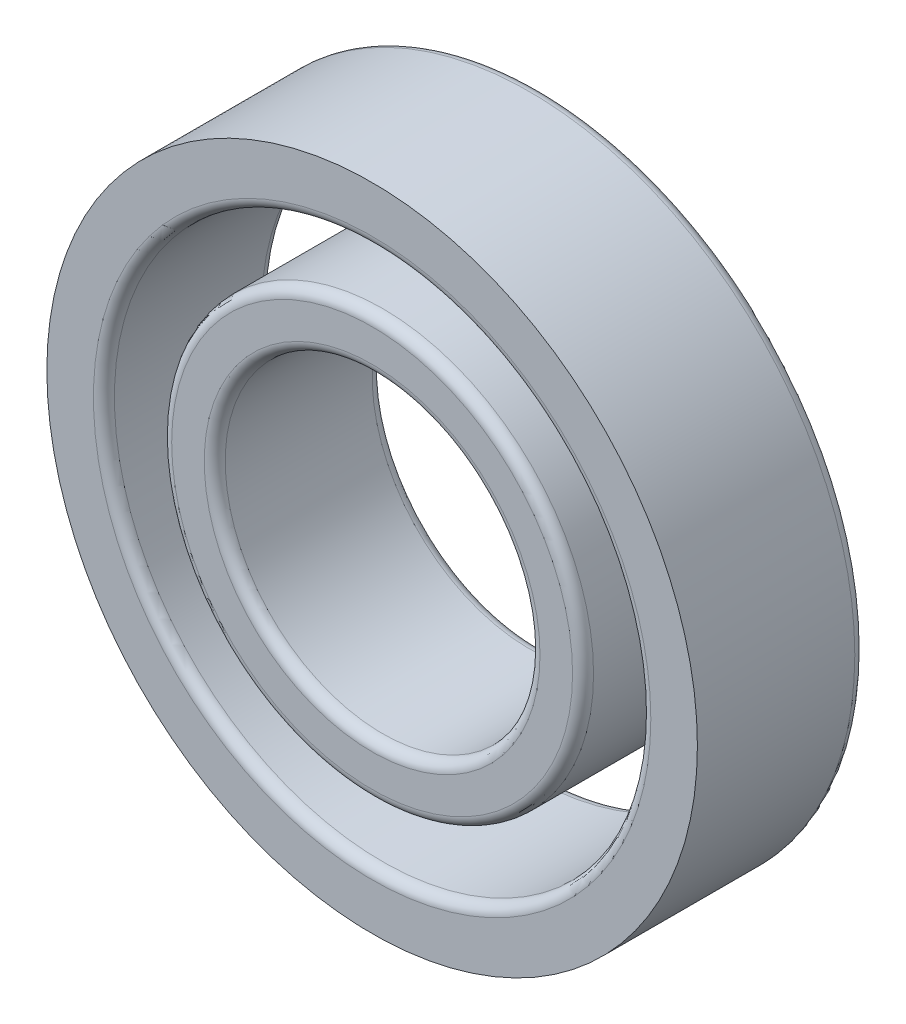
ISO-10303-21;
HEADER;
FILE_DESCRIPTION(('STEP AP214'),'2;1');
FILE_NAME('part.step','',(''),(''),'','','');
FILE_SCHEMA(('AUTOMOTIVE_DESIGN { 1 0 10303 214 1 1 1 1 }'));
ENDSEC;
DATA;
#1=APPLICATION_CONTEXT('core data for automotive mechanical design processes');
#2=APPLICATION_PROTOCOL_DEFINITION('international standard','automotive_design',2000,#1);
#3=PRODUCT_CONTEXT('',#1,'mechanical');
#4=PRODUCT('Part','Part','',(#3));
#5=PRODUCT_RELATED_PRODUCT_CATEGORY('part','',(#4));
#6=PRODUCT_DEFINITION_FORMATION('','',#4);
#7=PRODUCT_DEFINITION_CONTEXT('part definition',#1,'design');
#8=PRODUCT_DEFINITION('design','',#6,#7);
#9=PRODUCT_DEFINITION_SHAPE('','',#8);
#10=(LENGTH_UNIT() NAMED_UNIT(*) SI_UNIT(.MILLI.,.METRE.));
#11=(NAMED_UNIT(*) PLANE_ANGLE_UNIT() SI_UNIT($,.RADIAN.));
#12=(NAMED_UNIT(*) SI_UNIT($,.STERADIAN.) SOLID_ANGLE_UNIT());
#13=UNCERTAINTY_MEASURE_WITH_UNIT(LENGTH_MEASURE(1.E-05),#10,'distance_accuracy_value','');
#14=(GEOMETRIC_REPRESENTATION_CONTEXT(3) GLOBAL_UNCERTAINTY_ASSIGNED_CONTEXT((#13)) GLOBAL_UNIT_ASSIGNED_CONTEXT((#10,
#11,#12)) REPRESENTATION_CONTEXT('',''));
#15=CARTESIAN_POINT('',(0.,0.,0.));
#16=DIRECTION('',(0.,0.,1.));
#17=DIRECTION('',(1.,0.,0.));
#18=AXIS2_PLACEMENT_3D('',#15,#16,#17);
#19=CARTESIAN_POINT('',(0.,0.,16.));
#20=DIRECTION('',(0.,0.,-1.));
#21=DIRECTION('',(-1.,0.,0.));
#22=AXIS2_PLACEMENT_3D('',#19,#20,#21);
#23=CYLINDRICAL_SURFACE('',#22,15.);
#24=CARTESIAN_POINT('',(0.,0.,15.));
#25=DIRECTION('',(0.,0.,1.));
#26=DIRECTION('',(1.,0.,0.));
#27=AXIS2_PLACEMENT_3D('',#24,#25,#26);
#28=CIRCLE('',#27,15.);
#29=CARTESIAN_POINT('',(15.,0.,15.));
#30=VERTEX_POINT('',#29);
#31=EDGE_CURVE('E71',#30,#30,#28,.T.);
#32=ORIENTED_EDGE('',*,*,#31,.T.);
#33=EDGE_LOOP('',(#32));
#34=FACE_BOUND('',#33,.T.);
#35=CARTESIAN_POINT('',(0.,0.,1.));
#36=DIRECTION('',(0.,0.,1.));
#37=DIRECTION('',(1.,0.,0.));
#38=AXIS2_PLACEMENT_3D('',#35,#36,#37);
#39=CIRCLE('',#38,15.);
#40=CARTESIAN_POINT('',(15.,0.,1.));
#41=VERTEX_POINT('',#40);
#42=EDGE_CURVE('E74',#41,#41,#39,.F.);
#43=ORIENTED_EDGE('',*,*,#42,.T.);
#44=EDGE_LOOP('',(#43));
#45=FACE_BOUND('',#44,.T.);
#46=ADVANCED_FACE('F45',(#34,#45),#23,.F.);
#47=CARTESIAN_POINT('',(0.,0.,16.));
#48=DIRECTION('',(0.,0.,-1.));
#49=DIRECTION('',(-1.,0.,0.));
#50=AXIS2_PLACEMENT_3D('',#47,#48,#49);
#51=CYLINDRICAL_SURFACE('',#50,20.1028973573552);
#52=CARTESIAN_POINT('',(0.,0.,15.));
#53=DIRECTION('',(0.,0.,1.));
#54=DIRECTION('',(1.,0.,0.));
#55=AXIS2_PLACEMENT_3D('',#52,#53,#54);
#56=CIRCLE('',#55,20.1028973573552);
#57=CARTESIAN_POINT('',(20.1028973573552,0.,15.));
#58=VERTEX_POINT('',#57);
#59=EDGE_CURVE('E56',#58,#58,#56,.F.);
#60=ORIENTED_EDGE('',*,*,#59,.T.);
#61=EDGE_LOOP('',(#60));
#62=FACE_BOUND('',#61,.T.);
#63=CARTESIAN_POINT('',(0.,0.,1.));
#64=DIRECTION('',(0.,0.,1.));
#65=DIRECTION('',(1.,0.,0.));
#66=AXIS2_PLACEMENT_3D('',#63,#64,#65);
#67=CIRCLE('',#66,20.1028973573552);
#68=CARTESIAN_POINT('',(20.1028973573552,0.,1.));
#69=VERTEX_POINT('',#68);
#70=EDGE_CURVE('E60',#69,#69,#67,.T.);
#71=ORIENTED_EDGE('',*,*,#70,.T.);
#72=EDGE_LOOP('',(#71));
#73=FACE_BOUND('',#72,.T.);
#74=ADVANCED_FACE('F92',(#62,#73),#51,.T.);
#75=CARTESIAN_POINT('',(0.,-68.3414213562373,16.));
#76=DIRECTION('',(0.,0.,1.));
#77=DIRECTION('',(1.,0.,0.));
#78=AXIS2_PLACEMENT_3D('',#75,#76,#77);
#79=PLANE('',#78);
#80=CARTESIAN_POINT('',(0.,0.,16.));
#81=DIRECTION('',(0.,0.,1.));
#82=DIRECTION('',(1.,0.,0.));
#83=AXIS2_PLACEMENT_3D('',#80,#81,#82);
#84=CIRCLE('',#83,16.);
#85=CARTESIAN_POINT('',(16.,0.,16.));
#86=VERTEX_POINT('',#85);
#87=EDGE_CURVE('E65',#86,#86,#84,.F.);
#88=ORIENTED_EDGE('',*,*,#87,.T.);
#89=EDGE_LOOP('',(#88));
#90=FACE_BOUND('',#89,.T.);
#91=CARTESIAN_POINT('',(0.,0.,16.));
#92=DIRECTION('',(0.,0.,1.));
#93=DIRECTION('',(1.,0.,0.));
#94=AXIS2_PLACEMENT_3D('',#91,#92,#93);
#95=CIRCLE('',#94,19.1028973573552);
#96=CARTESIAN_POINT('',(19.1028973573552,0.,16.));
#97=VERTEX_POINT('',#96);
#98=EDGE_CURVE('E68',#97,#97,#95,.T.);
#99=ORIENTED_EDGE('',*,*,#98,.T.);
#100=EDGE_LOOP('',(#99));
#101=FACE_BOUND('',#100,.T.);
#102=ADVANCED_FACE('F98',(#90,#101),#79,.T.);
#103=CARTESIAN_POINT('',(0.,-68.3414213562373,0.));
#104=DIRECTION('',(0.,0.,1.));
#105=DIRECTION('',(1.,0.,0.));
#106=AXIS2_PLACEMENT_3D('',#103,#104,#105);
#107=PLANE('',#106);
#108=CARTESIAN_POINT('',(0.,0.,0.));
#109=DIRECTION('',(0.,0.,1.));
#110=DIRECTION('',(1.,0.,0.));
#111=AXIS2_PLACEMENT_3D('',#108,#109,#110);
#112=CIRCLE('',#111,16.);
#113=CARTESIAN_POINT('',(16.,0.,0.));
#114=VERTEX_POINT('',#113);
#115=EDGE_CURVE('E12',#114,#114,#112,.T.);
#116=ORIENTED_EDGE('',*,*,#115,.T.);
#117=EDGE_LOOP('',(#116));
#118=FACE_BOUND('',#117,.T.);
#119=CARTESIAN_POINT('',(0.,0.,0.));
#120=DIRECTION('',(0.,0.,1.));
#121=DIRECTION('',(1.,0.,0.));
#122=AXIS2_PLACEMENT_3D('',#119,#120,#121);
#123=CIRCLE('',#122,19.1028973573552);
#124=CARTESIAN_POINT('',(19.1028973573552,0.,0.));
#125=VERTEX_POINT('',#124);
#126=EDGE_CURVE('E52',#125,#125,#123,.F.);
#127=ORIENTED_EDGE('',*,*,#126,.T.);
#128=EDGE_LOOP('',(#127));
#129=FACE_BOUND('',#128,.T.);
#130=ADVANCED_FACE('F104',(#118,#129),#107,.F.);
#131=CARTESIAN_POINT('',(0.,0.,15.));
#132=DIRECTION('',(0.,0.,1.));
#133=DIRECTION('',(1.,0.,0.));
#134=AXIS2_PLACEMENT_3D('',#131,#132,#133);
#135=TOROIDAL_SURFACE('',#134,16.,1.);
#136=ORIENTED_EDGE('',*,*,#87,.F.);
#137=EDGE_LOOP('',(#136));
#138=FACE_BOUND('',#137,.T.);
#139=ORIENTED_EDGE('',*,*,#31,.F.);
#140=EDGE_LOOP('',(#139));
#141=FACE_BOUND('',#140,.T.);
#142=ADVANCED_FACE('F88',(#138,#141),#135,.T.);
#143=CARTESIAN_POINT('',(0.,0.,15.));
#144=DIRECTION('',(0.,0.,1.));
#145=DIRECTION('',(1.,0.,0.));
#146=AXIS2_PLACEMENT_3D('',#143,#144,#145);
#147=TOROIDAL_SURFACE('',#146,19.1028973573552,1.);
#148=ORIENTED_EDGE('',*,*,#59,.F.);
#149=EDGE_LOOP('',(#148));
#150=FACE_BOUND('',#149,.T.);
#151=ORIENTED_EDGE('',*,*,#98,.F.);
#152=EDGE_LOOP('',(#151));
#153=FACE_BOUND('',#152,.T.);
#154=ADVANCED_FACE('F82',(#150,#153),#147,.T.);
#155=CARTESIAN_POINT('',(0.,0.,1.));
#156=DIRECTION('',(0.,0.,1.));
#157=DIRECTION('',(1.,0.,0.));
#158=AXIS2_PLACEMENT_3D('',#155,#156,#157);
#159=TOROIDAL_SURFACE('',#158,16.,1.);
#160=ORIENTED_EDGE('',*,*,#42,.F.);
#161=EDGE_LOOP('',(#160));
#162=FACE_BOUND('',#161,.T.);
#163=ORIENTED_EDGE('',*,*,#115,.F.);
#164=EDGE_LOOP('',(#163));
#165=FACE_BOUND('',#164,.T.);
#166=ADVANCED_FACE('F79',(#162,#165),#159,.T.);
#167=CARTESIAN_POINT('',(0.,0.,1.));
#168=DIRECTION('',(0.,0.,1.));
#169=DIRECTION('',(1.,0.,0.));
#170=AXIS2_PLACEMENT_3D('',#167,#168,#169);
#171=TOROIDAL_SURFACE('',#170,19.1028973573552,1.);
#172=ORIENTED_EDGE('',*,*,#126,.F.);
#173=EDGE_LOOP('',(#172));
#174=FACE_BOUND('',#173,.T.);
#175=ORIENTED_EDGE('',*,*,#70,.F.);
#176=EDGE_LOOP('',(#175));
#177=FACE_BOUND('',#176,.T.);
#178=ADVANCED_FACE('F47',(#174,#177),#171,.T.);
#179=CLOSED_SHELL('',(#46,#74,#102,#130,#142,#154,#166,#178));
#180=MANIFOLD_SOLID_BREP('B2',#179);
#181=CARTESIAN_POINT('',(0.,0.,16.));
#182=DIRECTION('',(0.,0.,-1.));
#183=DIRECTION('',(-1.,0.,0.));
#184=AXIS2_PLACEMENT_3D('',#181,#182,#183);
#185=CYLINDRICAL_SURFACE('',#184,25.5602716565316);
#186=CARTESIAN_POINT('',(0.,0.,15.));
#187=DIRECTION('',(0.,0.,1.));
#188=DIRECTION('',(1.,0.,0.));
#189=AXIS2_PLACEMENT_3D('',#186,#187,#188);
#190=CIRCLE('',#189,25.5602716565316);
#191=CARTESIAN_POINT('',(25.5602716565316,0.,15.));
#192=VERTEX_POINT('',#191);
#193=EDGE_CURVE('E174',#192,#192,#190,.T.);
#194=ORIENTED_EDGE('',*,*,#193,.T.);
#195=EDGE_LOOP('',(#194));
#196=FACE_BOUND('',#195,.T.);
#197=CARTESIAN_POINT('',(0.,0.,1.));
#198=DIRECTION('',(0.,0.,1.));
#199=DIRECTION('',(1.,0.,0.));
#200=AXIS2_PLACEMENT_3D('',#197,#198,#199);
#201=CIRCLE('',#200,25.5602716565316);
#202=CARTESIAN_POINT('',(25.5602716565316,0.,1.));
#203=VERTEX_POINT('',#202);
#204=EDGE_CURVE('E178',#203,#203,#201,.F.);
#205=ORIENTED_EDGE('',*,*,#204,.T.);
#206=EDGE_LOOP('',(#205));
#207=FACE_BOUND('',#206,.T.);
#208=ADVANCED_FACE('F167',(#196,#207),#185,.F.);
#209=CARTESIAN_POINT('',(0.,0.,16.));
#210=DIRECTION('',(0.,0.,-1.));
#211=DIRECTION('',(-1.,0.,0.));
#212=AXIS2_PLACEMENT_3D('',#209,#210,#211);
#213=CYLINDRICAL_SURFACE('',#212,31.);
#214=CARTESIAN_POINT('',(0.,0.,1.));
#215=DIRECTION('',(0.,0.,1.));
#216=DIRECTION('',(1.,0.,0.));
#217=AXIS2_PLACEMENT_3D('',#214,#215,#216);
#218=CIRCLE('',#217,31.);
#219=CARTESIAN_POINT('',(31.,0.,1.));
#220=VERTEX_POINT('',#219);
#221=EDGE_CURVE('E190',#220,#220,#218,.T.);
#222=ORIENTED_EDGE('',*,*,#221,.T.);
#223=EDGE_LOOP('',(#222));
#224=FACE_BOUND('',#223,.T.);
#225=CARTESIAN_POINT('',(0.,0.,16.));
#226=DIRECTION('',(0.,0.,1.));
#227=DIRECTION('',(1.,0.,0.));
#228=AXIS2_PLACEMENT_3D('',#225,#226,#227);
#229=CIRCLE('',#228,31.);
#230=CARTESIAN_POINT('',(31.,0.,16.));
#231=VERTEX_POINT('',#230);
#232=EDGE_CURVE('E193',#231,#231,#229,.T.);
#233=ORIENTED_EDGE('',*,*,#232,.F.);
#234=EDGE_LOOP('',(#233));
#235=FACE_BOUND('',#234,.T.);
#236=ADVANCED_FACE('F199',(#224,#235),#213,.T.);
#237=CARTESIAN_POINT('',(0.,-68.3414213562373,16.));
#238=DIRECTION('',(0.,0.,1.));
#239=DIRECTION('',(1.,0.,0.));
#240=AXIS2_PLACEMENT_3D('',#237,#238,#239);
#241=PLANE('',#240);
#242=CARTESIAN_POINT('',(0.,0.,16.));
#243=DIRECTION('',(0.,0.,1.));
#244=DIRECTION('',(1.,0.,0.));
#245=AXIS2_PLACEMENT_3D('',#242,#243,#244);
#246=CIRCLE('',#245,26.5602716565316);
#247=CARTESIAN_POINT('',(26.5602716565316,0.,16.));
#248=VERTEX_POINT('',#247);
#249=EDGE_CURVE('E44',#248,#248,#246,.F.);
#250=ORIENTED_EDGE('',*,*,#249,.T.);
#251=EDGE_LOOP('',(#250));
#252=FACE_BOUND('',#251,.T.);
#253=ORIENTED_EDGE('',*,*,#232,.T.);
#254=EDGE_LOOP('',(#253));
#255=FACE_BOUND('',#254,.T.);
#256=ADVANCED_FACE('F197',(#252,#255),#241,.T.);
#257=CARTESIAN_POINT('',(0.,-68.3414213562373,0.));
#258=DIRECTION('',(0.,0.,1.));
#259=DIRECTION('',(1.,0.,0.));
#260=AXIS2_PLACEMENT_3D('',#257,#258,#259);
#261=PLANE('',#260);
#262=CARTESIAN_POINT('',(0.,0.,0.));
#263=DIRECTION('',(0.,0.,1.));
#264=DIRECTION('',(1.,0.,0.));
#265=AXIS2_PLACEMENT_3D('',#262,#263,#264);
#266=CIRCLE('',#265,30.);
#267=CARTESIAN_POINT('',(30.,0.,0.));
#268=VERTEX_POINT('',#267);
#269=EDGE_CURVE('E182',#268,#268,#266,.F.);
#270=ORIENTED_EDGE('',*,*,#269,.T.);
#271=EDGE_LOOP('',(#270));
#272=FACE_BOUND('',#271,.T.);
#273=CARTESIAN_POINT('',(0.,0.,0.));
#274=DIRECTION('',(0.,0.,1.));
#275=DIRECTION('',(1.,0.,0.));
#276=AXIS2_PLACEMENT_3D('',#273,#274,#275);
#277=CIRCLE('',#276,26.5602716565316);
#278=CARTESIAN_POINT('',(26.5602716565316,0.,0.));
#279=VERTEX_POINT('',#278);
#280=EDGE_CURVE('E187',#279,#279,#277,.T.);
#281=ORIENTED_EDGE('',*,*,#280,.T.);
#282=EDGE_LOOP('',(#281));
#283=FACE_BOUND('',#282,.T.);
#284=ADVANCED_FACE('F207',(#272,#283),#261,.F.);
#285=CARTESIAN_POINT('',(0.,0.,1.));
#286=DIRECTION('',(0.,0.,1.));
#287=DIRECTION('',(1.,0.,0.));
#288=AXIS2_PLACEMENT_3D('',#285,#286,#287);
#289=TOROIDAL_SURFACE('',#288,30.,1.);
#290=ORIENTED_EDGE('',*,*,#269,.F.);
#291=EDGE_LOOP('',(#290));
#292=FACE_BOUND('',#291,.T.);
#293=ORIENTED_EDGE('',*,*,#221,.F.);
#294=EDGE_LOOP('',(#293));
#295=FACE_BOUND('',#294,.T.);
#296=ADVANCED_FACE('F212',(#292,#295),#289,.T.);
#297=CARTESIAN_POINT('',(0.,0.,15.));
#298=DIRECTION('',(0.,0.,1.));
#299=DIRECTION('',(1.,0.,0.));
#300=AXIS2_PLACEMENT_3D('',#297,#298,#299);
#301=TOROIDAL_SURFACE('',#300,26.5602716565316,1.);
#302=ORIENTED_EDGE('',*,*,#249,.F.);
#303=EDGE_LOOP('',(#302));
#304=FACE_BOUND('',#303,.T.);
#305=ORIENTED_EDGE('',*,*,#193,.F.);
#306=EDGE_LOOP('',(#305));
#307=FACE_BOUND('',#306,.T.);
#308=ADVANCED_FACE('F214',(#304,#307),#301,.T.);
#309=CARTESIAN_POINT('',(0.,0.,1.));
#310=DIRECTION('',(0.,0.,1.));
#311=DIRECTION('',(1.,0.,0.));
#312=AXIS2_PLACEMENT_3D('',#309,#310,#311);
#313=TOROIDAL_SURFACE('',#312,26.5602716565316,1.);
#314=ORIENTED_EDGE('',*,*,#204,.F.);
#315=EDGE_LOOP('',(#314));
#316=FACE_BOUND('',#315,.T.);
#317=ORIENTED_EDGE('',*,*,#280,.F.);
#318=EDGE_LOOP('',(#317));
#319=FACE_BOUND('',#318,.T.);
#320=ADVANCED_FACE('F169',(#316,#319),#313,.T.);
#321=CLOSED_SHELL('',(#208,#236,#256,#284,#296,#308,#320));
#322=MANIFOLD_SOLID_BREP('B7',#321);
#323=ADVANCED_BREP_SHAPE_REPRESENTATION('',(#18,#180,#322),#14);
#324=SHAPE_DEFINITION_REPRESENTATION(#9,#323);
ENDSEC;
END-ISO-10303-21;
